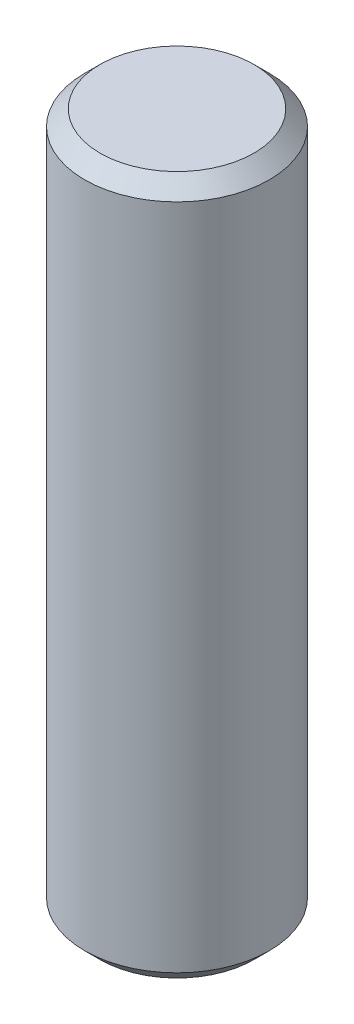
from build123d import *

# Parameters (mm, degrees)
SKETCH_1_R      = 3
EXTRUDE_1_DEPTH = 22.7
CHAMFER_1_SIZE  = 0.5
CHAMFER_2_SIZE  = 0.5


with BuildPart() as part:
    # Sketch 1 → Extrude 1 (new body)
    with BuildSketch(Plane(origin=(0, 0, 0), x_dir=(1, 0, 0), z_dir=(0, 1, 0))):
        with Locations(Location((0, 0, 0), (0, 0, 270))):
            Circle(SKETCH_1_R)
    extrude(amount=EXTRUDE_1_DEPTH)

    # Chamfer 1
    chamfer_1_edges = [part.edges().sort_by_distance(p)[0] for p in [
        (0, 22.7, -3),
    ]]
    chamfer(chamfer_1_edges, length=CHAMFER_1_SIZE)

    # Chamfer 2
    chamfer_2_edges = [part.edges().sort_by_distance(p)[0] for p in [
        (0, 0, -3),
    ]]
    chamfer(chamfer_2_edges, length=CHAMFER_2_SIZE)


solid = part.part
